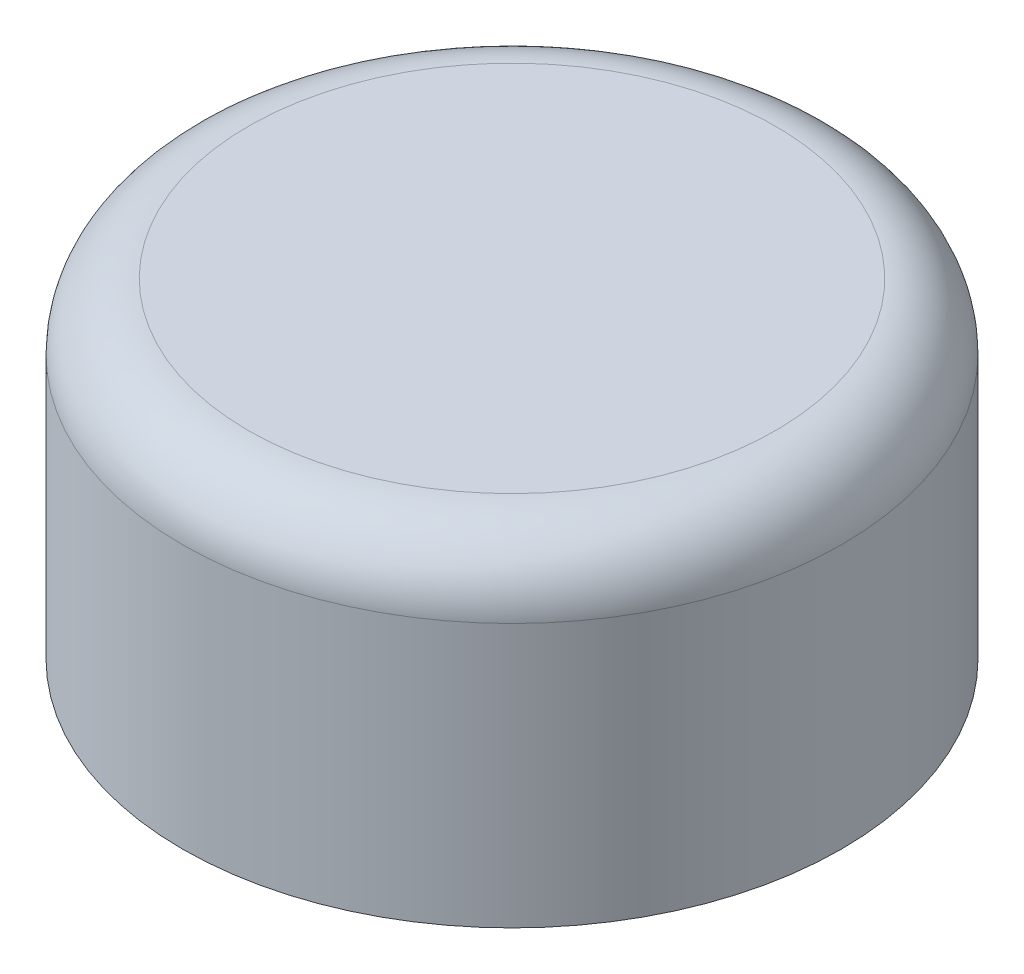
ISO-10303-21;
HEADER;
FILE_DESCRIPTION(('STEP AP214'),'2;1');
FILE_NAME('part.step','',(''),(''),'','','');
FILE_SCHEMA(('AUTOMOTIVE_DESIGN { 1 0 10303 214 1 1 1 1 }'));
ENDSEC;
DATA;
#1=APPLICATION_CONTEXT('core data for automotive mechanical design processes');
#2=APPLICATION_PROTOCOL_DEFINITION('international standard','automotive_design',2000,#1);
#3=PRODUCT_CONTEXT('',#1,'mechanical');
#4=PRODUCT('Part','Part','',(#3));
#5=PRODUCT_RELATED_PRODUCT_CATEGORY('part','',(#4));
#6=PRODUCT_DEFINITION_FORMATION('','',#4);
#7=PRODUCT_DEFINITION_CONTEXT('part definition',#1,'design');
#8=PRODUCT_DEFINITION('design','',#6,#7);
#9=PRODUCT_DEFINITION_SHAPE('','',#8);
#10=(LENGTH_UNIT() NAMED_UNIT(*) SI_UNIT(.MILLI.,.METRE.));
#11=(NAMED_UNIT(*) PLANE_ANGLE_UNIT() SI_UNIT($,.RADIAN.));
#12=(NAMED_UNIT(*) SI_UNIT($,.STERADIAN.) SOLID_ANGLE_UNIT());
#13=UNCERTAINTY_MEASURE_WITH_UNIT(LENGTH_MEASURE(1.E-05),#10,'distance_accuracy_value','');
#14=(GEOMETRIC_REPRESENTATION_CONTEXT(3) GLOBAL_UNCERTAINTY_ASSIGNED_CONTEXT((#13)) GLOBAL_UNIT_ASSIGNED_CONTEXT((#10,
#11,#12)) REPRESENTATION_CONTEXT('',''));
#15=CARTESIAN_POINT('',(0.,0.,0.));
#16=DIRECTION('',(0.,0.,1.));
#17=DIRECTION('',(1.,0.,0.));
#18=AXIS2_PLACEMENT_3D('',#15,#16,#17);
#19=CARTESIAN_POINT('',(0.,10.,0.));
#20=DIRECTION('',(0.,-1.,0.));
#21=DIRECTION('',(0.,0.,-1.));
#22=AXIS2_PLACEMENT_3D('',#19,#20,#21);
#23=CYLINDRICAL_SURFACE('',#22,10.);
#24=CARTESIAN_POINT('',(0.,8.,0.));
#25=DIRECTION('',(0.,1.,0.));
#26=DIRECTION('',(0.,0.,1.));
#27=AXIS2_PLACEMENT_3D('',#24,#25,#26);
#28=CIRCLE('',#27,10.);
#29=CARTESIAN_POINT('',(0.,8.,10.));
#30=VERTEX_POINT('',#29);
#31=EDGE_CURVE('E10',#30,#30,#28,.F.);
#32=ORIENTED_EDGE('',*,*,#31,.T.);
#33=EDGE_LOOP('',(#32));
#34=FACE_BOUND('',#33,.T.);
#35=CARTESIAN_POINT('',(0.,0.,0.));
#36=DIRECTION('',(0.,1.,0.));
#37=DIRECTION('',(0.,0.,1.));
#38=AXIS2_PLACEMENT_3D('',#35,#36,#37);
#39=CIRCLE('',#38,10.);
#40=CARTESIAN_POINT('',(0.,0.,10.));
#41=VERTEX_POINT('',#40);
#42=EDGE_CURVE('E42',#41,#41,#39,.T.);
#43=ORIENTED_EDGE('',*,*,#42,.T.);
#44=EDGE_LOOP('',(#43));
#45=FACE_BOUND('',#44,.T.);
#46=ADVANCED_FACE('F31',(#34,#45),#23,.T.);
#47=CARTESIAN_POINT('',(0.,10.,0.));
#48=DIRECTION('',(0.,1.,0.));
#49=DIRECTION('',(0.,0.,1.));
#50=AXIS2_PLACEMENT_3D('',#47,#48,#49);
#51=PLANE('',#50);
#52=CARTESIAN_POINT('',(0.,10.,0.));
#53=DIRECTION('',(0.,1.,0.));
#54=DIRECTION('',(0.,0.,1.));
#55=AXIS2_PLACEMENT_3D('',#52,#53,#54);
#56=CIRCLE('',#55,8.);
#57=CARTESIAN_POINT('',(0.,10.,8.));
#58=VERTEX_POINT('',#57);
#59=EDGE_CURVE('E38',#58,#58,#56,.T.);
#60=ORIENTED_EDGE('',*,*,#59,.T.);
#61=EDGE_LOOP('',(#60));
#62=FACE_BOUND('',#61,.T.);
#63=ADVANCED_FACE('F66',(#62),#51,.T.);
#64=CARTESIAN_POINT('',(0.,0.,0.));
#65=DIRECTION('',(0.,1.,0.));
#66=DIRECTION('',(0.,0.,1.));
#67=AXIS2_PLACEMENT_3D('',#64,#65,#66);
#68=PLANE('',#67);
#69=CARTESIAN_POINT('',(0.,0.,0.));
#70=DIRECTION('',(0.,-1.,0.));
#71=DIRECTION('',(0.,0.,-1.));
#72=AXIS2_PLACEMENT_3D('',#69,#70,#71);
#73=CIRCLE('',#72,4.);
#74=CARTESIAN_POINT('',(0.,0.,-4.));
#75=VERTEX_POINT('',#74);
#76=EDGE_CURVE('E49',#75,#75,#73,.T.);
#77=ORIENTED_EDGE('',*,*,#76,.F.);
#78=EDGE_LOOP('',(#77));
#79=FACE_BOUND('',#78,.T.);
#80=ORIENTED_EDGE('',*,*,#42,.F.);
#81=EDGE_LOOP('',(#80));
#82=FACE_BOUND('',#81,.T.);
#83=ADVANCED_FACE('F63',(#79,#82),#68,.F.);
#84=CARTESIAN_POINT('',(0.,8.,0.));
#85=DIRECTION('',(0.,1.,0.));
#86=DIRECTION('',(0.,0.,1.));
#87=AXIS2_PLACEMENT_3D('',#84,#85,#86);
#88=TOROIDAL_SURFACE('',#87,8.,2.);
#89=ORIENTED_EDGE('',*,*,#31,.F.);
#90=EDGE_LOOP('',(#89));
#91=FACE_BOUND('',#90,.T.);
#92=ORIENTED_EDGE('',*,*,#59,.F.);
#93=EDGE_LOOP('',(#92));
#94=FACE_BOUND('',#93,.T.);
#95=ADVANCED_FACE('F33',(#91,#94),#88,.T.);
#96=CARTESIAN_POINT('',(0.,5.,0.));
#97=DIRECTION('',(0.,-1.,0.));
#98=DIRECTION('',(0.,0.,-1.));
#99=AXIS2_PLACEMENT_3D('',#96,#97,#98);
#100=CYLINDRICAL_SURFACE('',#99,4.);
#101=CARTESIAN_POINT('',(0.,5.,0.));
#102=DIRECTION('',(0.,-1.,0.));
#103=DIRECTION('',(0.,0.,-1.));
#104=AXIS2_PLACEMENT_3D('',#101,#102,#103);
#105=CIRCLE('',#104,4.);
#106=CARTESIAN_POINT('',(0.,5.,-4.));
#107=VERTEX_POINT('',#106);
#108=EDGE_CURVE('E46',#107,#107,#105,.T.);
#109=ORIENTED_EDGE('',*,*,#108,.F.);
#110=EDGE_LOOP('',(#109));
#111=FACE_BOUND('',#110,.T.);
#112=ORIENTED_EDGE('',*,*,#76,.T.);
#113=EDGE_LOOP('',(#112));
#114=FACE_BOUND('',#113,.T.);
#115=ADVANCED_FACE('F57',(#111,#114),#100,.F.);
#116=CARTESIAN_POINT('',(0.,5.,0.));
#117=DIRECTION('',(0.,-1.,0.));
#118=DIRECTION('',(0.,0.,-1.));
#119=AXIS2_PLACEMENT_3D('',#116,#117,#118);
#120=PLANE('',#119);
#121=ORIENTED_EDGE('',*,*,#108,.T.);
#122=EDGE_LOOP('',(#121));
#123=FACE_BOUND('',#122,.T.);
#124=ADVANCED_FACE('F55',(#123),#120,.T.);
#125=CLOSED_SHELL('',(#46,#63,#83,#95,#115,#124));
#126=MANIFOLD_SOLID_BREP('B2',#125);
#127=ADVANCED_BREP_SHAPE_REPRESENTATION('',(#18,#126),#14);
#128=SHAPE_DEFINITION_REPRESENTATION(#9,#127);
ENDSEC;
END-ISO-10303-21;
